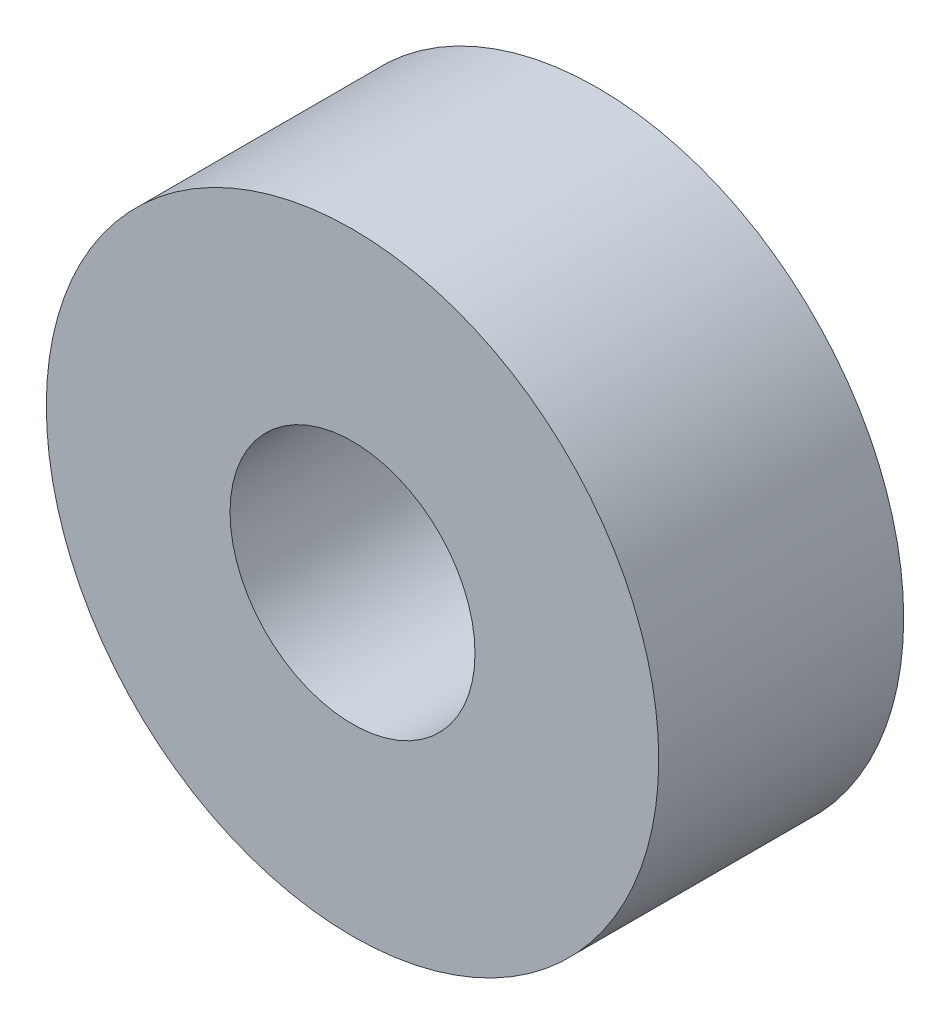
ISO-10303-21;
HEADER;
FILE_DESCRIPTION(('STEP AP214'),'2;1');
FILE_NAME('part.step','',(''),(''),'','','');
FILE_SCHEMA(('AUTOMOTIVE_DESIGN { 1 0 10303 214 1 1 1 1 }'));
ENDSEC;
DATA;
#1=APPLICATION_CONTEXT('core data for automotive mechanical design processes');
#2=APPLICATION_PROTOCOL_DEFINITION('international standard','automotive_design',2000,#1);
#3=PRODUCT_CONTEXT('',#1,'mechanical');
#4=PRODUCT('Part','Part','',(#3));
#5=PRODUCT_RELATED_PRODUCT_CATEGORY('part','',(#4));
#6=PRODUCT_DEFINITION_FORMATION('','',#4);
#7=PRODUCT_DEFINITION_CONTEXT('part definition',#1,'design');
#8=PRODUCT_DEFINITION('design','',#6,#7);
#9=PRODUCT_DEFINITION_SHAPE('','',#8);
#10=(LENGTH_UNIT() NAMED_UNIT(*) SI_UNIT(.MILLI.,.METRE.));
#11=(NAMED_UNIT(*) PLANE_ANGLE_UNIT() SI_UNIT($,.RADIAN.));
#12=(NAMED_UNIT(*) SI_UNIT($,.STERADIAN.) SOLID_ANGLE_UNIT());
#13=UNCERTAINTY_MEASURE_WITH_UNIT(LENGTH_MEASURE(1.E-05),#10,'distance_accuracy_value','');
#14=(GEOMETRIC_REPRESENTATION_CONTEXT(3) GLOBAL_UNCERTAINTY_ASSIGNED_CONTEXT((#13)) GLOBAL_UNIT_ASSIGNED_CONTEXT((#10,
#11,#12)) REPRESENTATION_CONTEXT('',''));
#15=CARTESIAN_POINT('',(0.,0.,0.));
#16=DIRECTION('',(0.,0.,1.));
#17=DIRECTION('',(1.,0.,0.));
#18=AXIS2_PLACEMENT_3D('',#15,#16,#17);
#19=CARTESIAN_POINT('',(0.,0.,20.));
#20=DIRECTION('',(0.,0.,1.));
#21=DIRECTION('',(1.,0.,0.));
#22=AXIS2_PLACEMENT_3D('',#19,#20,#21);
#23=PLANE('',#22);
#24=CARTESIAN_POINT('',(0.,0.,20.));
#25=DIRECTION('',(0.,0.,1.));
#26=DIRECTION('',(1.,0.,0.));
#27=AXIS2_PLACEMENT_3D('',#24,#25,#26);
#28=CIRCLE('',#27,25.);
#29=CARTESIAN_POINT('',(25.,0.,20.));
#30=VERTEX_POINT('',#29);
#31=EDGE_CURVE('E10',#30,#30,#28,.T.);
#32=ORIENTED_EDGE('',*,*,#31,.T.);
#33=EDGE_LOOP('',(#32));
#34=FACE_BOUND('',#33,.T.);
#35=CARTESIAN_POINT('',(0.,0.,20.));
#36=DIRECTION('',(0.,0.,1.));
#37=DIRECTION('',(1.,0.,0.));
#38=AXIS2_PLACEMENT_3D('',#35,#36,#37);
#39=CIRCLE('',#38,10.);
#40=CARTESIAN_POINT('',(10.,0.,20.));
#41=VERTEX_POINT('',#40);
#42=EDGE_CURVE('E46',#41,#41,#39,.T.);
#43=ORIENTED_EDGE('',*,*,#42,.F.);
#44=EDGE_LOOP('',(#43));
#45=FACE_BOUND('',#44,.T.);
#46=ADVANCED_FACE('F35',(#34,#45),#23,.T.);
#47=CARTESIAN_POINT('',(0.,0.,0.));
#48=DIRECTION('',(0.,0.,1.));
#49=DIRECTION('',(1.,0.,0.));
#50=AXIS2_PLACEMENT_3D('',#47,#48,#49);
#51=PLANE('',#50);
#52=CARTESIAN_POINT('',(0.,0.,0.));
#53=DIRECTION('',(0.,0.,1.));
#54=DIRECTION('',(1.,0.,0.));
#55=AXIS2_PLACEMENT_3D('',#52,#53,#54);
#56=CIRCLE('',#55,25.);
#57=CARTESIAN_POINT('',(25.,0.,0.));
#58=VERTEX_POINT('',#57);
#59=EDGE_CURVE('E39',#58,#58,#56,.T.);
#60=ORIENTED_EDGE('',*,*,#59,.F.);
#61=EDGE_LOOP('',(#60));
#62=FACE_BOUND('',#61,.T.);
#63=CARTESIAN_POINT('',(0.,0.,0.));
#64=DIRECTION('',(0.,0.,1.));
#65=DIRECTION('',(1.,0.,0.));
#66=AXIS2_PLACEMENT_3D('',#63,#64,#65);
#67=CIRCLE('',#66,10.);
#68=CARTESIAN_POINT('',(10.,0.,0.));
#69=VERTEX_POINT('',#68);
#70=EDGE_CURVE('E48',#69,#69,#67,.T.);
#71=ORIENTED_EDGE('',*,*,#70,.T.);
#72=EDGE_LOOP('',(#71));
#73=FACE_BOUND('',#72,.T.);
#74=ADVANCED_FACE('F58',(#62,#73),#51,.F.);
#75=CARTESIAN_POINT('',(0.,0.,20.));
#76=DIRECTION('',(0.,0.,-1.));
#77=DIRECTION('',(-1.,0.,0.));
#78=AXIS2_PLACEMENT_3D('',#75,#76,#77);
#79=CYLINDRICAL_SURFACE('',#78,25.);
#80=ORIENTED_EDGE('',*,*,#31,.F.);
#81=EDGE_LOOP('',(#80));
#82=FACE_BOUND('',#81,.T.);
#83=ORIENTED_EDGE('',*,*,#59,.T.);
#84=EDGE_LOOP('',(#83));
#85=FACE_BOUND('',#84,.T.);
#86=ADVANCED_FACE('F37',(#82,#85),#79,.T.);
#87=CARTESIAN_POINT('',(0.,0.,20.));
#88=DIRECTION('',(0.,0.,-1.));
#89=DIRECTION('',(-1.,0.,0.));
#90=AXIS2_PLACEMENT_3D('',#87,#88,#89);
#91=CYLINDRICAL_SURFACE('',#90,10.);
#92=ORIENTED_EDGE('',*,*,#42,.T.);
#93=EDGE_LOOP('',(#92));
#94=FACE_BOUND('',#93,.T.);
#95=ORIENTED_EDGE('',*,*,#70,.F.);
#96=EDGE_LOOP('',(#95));
#97=FACE_BOUND('',#96,.T.);
#98=ADVANCED_FACE('F54',(#94,#97),#91,.F.);
#99=CLOSED_SHELL('',(#46,#74,#86,#98));
#100=MANIFOLD_SOLID_BREP('B2',#99);
#101=ADVANCED_BREP_SHAPE_REPRESENTATION('',(#18,#100),#14);
#102=SHAPE_DEFINITION_REPRESENTATION(#9,#101);
ENDSEC;
END-ISO-10303-21;
